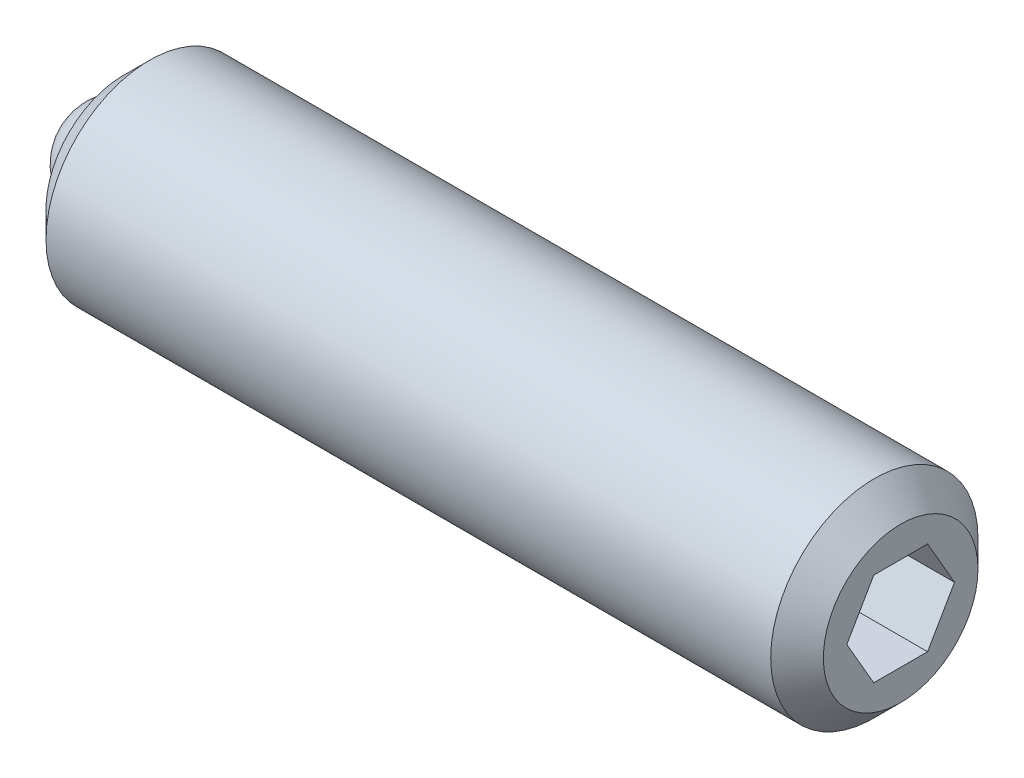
from build123d import *

# Parameters (mm, degrees)
SKETCH2_R           = 1
BOSS_EXTRUDE1_DEPTH = 7.5
CHAMFER1_SIZE       = 0.254
CHAMFER2_SIZE       = 0.254
CUT_EXTRUDE2_DEPTH  = 2
SKETCH3_R           = 0.5
CUT_EXTRUDE3_DEPTH  = 0.5


with BuildPart() as part:
    # Sketch2 → Boss-Extrude1 (new body)
    with BuildSketch(Plane(origin=(0, 0, 0), x_dir=(0, 0, -1), z_dir=(1, 0, 0))):
        Circle(SKETCH2_R)
    extrude(amount=BOSS_EXTRUDE1_DEPTH)

    # Chamfer1
    chamfer1_edges = [part.edges().sort_by_distance(p)[0] for p in [
        (0, 0, 1),
    ]]
    chamfer(chamfer1_edges, length=CHAMFER1_SIZE)

    # Chamfer2
    chamfer2_edges = [part.edges().sort_by_distance(p)[0] for p in [
        (7.5, 0, 1),
    ]]
    chamfer(chamfer2_edges, length=CHAMFER2_SIZE)

    # Sketch4 → Cut-Extrude2 (cut)
    with BuildSketch(Plane(origin=(7.5, 0, 0), x_dir=(0, 0, -1), z_dir=(1, 0, 0))):
        Polygon((0.519615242, 0), (0.259807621, 0.45), (-0.259807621, 0.45), (-0.519615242, 0), (-0.259807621, -0.45), (0.259807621, -0.45), align=None)
    extrude(amount=-CUT_EXTRUDE2_DEPTH, mode=Mode.SUBTRACT)

    # Sketch3 → Cut-Extrude3 (cut)
    with BuildSketch(Plane.ZY):
        Circle(SKETCH3_R)
    extrude(amount=-CUT_EXTRUDE3_DEPTH, mode=Mode.SUBTRACT)


with BuildPart() as body_2:
    # Sketch5 → Revolve1 (revolve)
    with BuildSketch(Plane.ZY):
        with BuildLine():
            Line((0, 0), (0, -0.5))
            ThreePointArc((0, -0.5), (-0.5, 0), (0, 0.5))
            Line((0, 0.5), (0, 0))
        make_face()
    revolve(axis=Axis((0, 0, 0), (0, 1, 0)))


solid = Compound([part.part, body_2.part])
